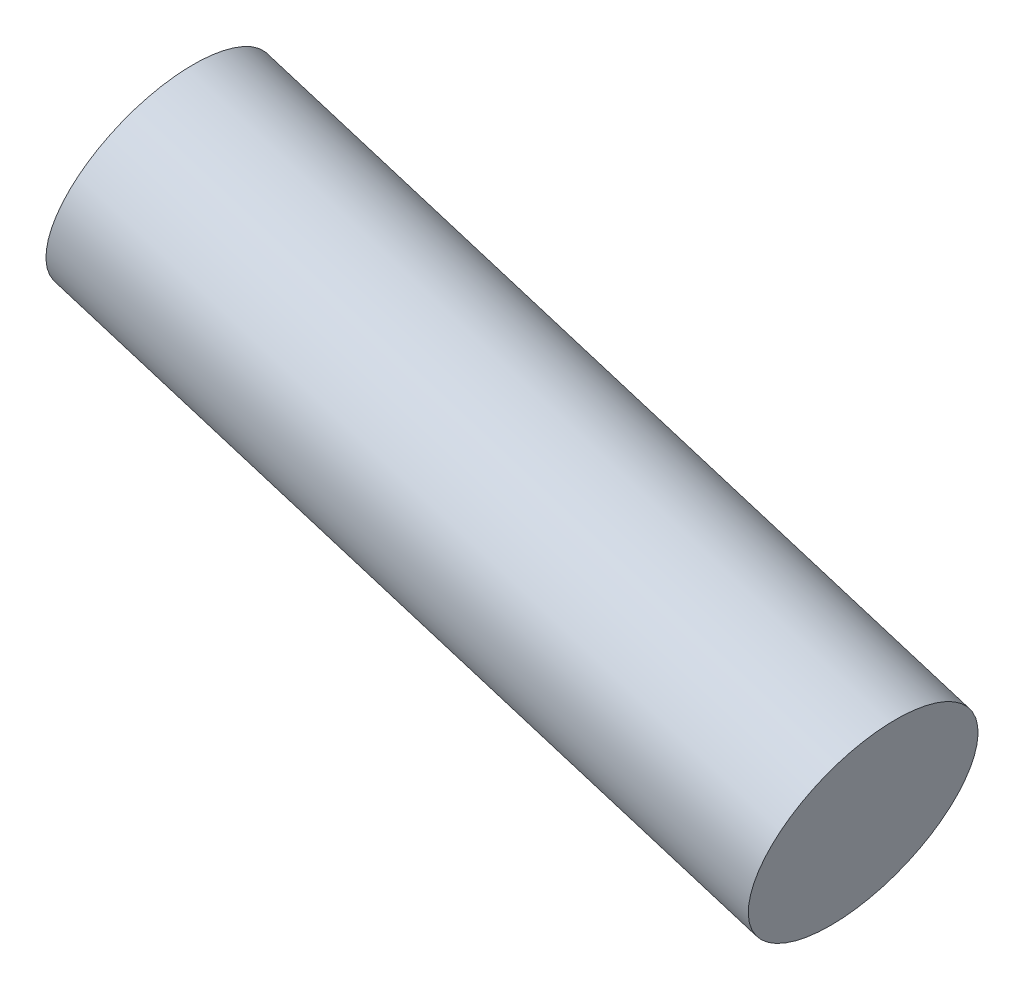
from build123d import *


with BuildPart() as part:
    # Skizze1 → Rotation1 (revolve)
    with BuildSketch(Plane.XY, mode=Mode.PRIVATE) as rotation1_sk:
        Polygon((769.020865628, -220.979429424), (764.608693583, -235.315842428), (860.184780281, -264.730322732), (864.596952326, -250.393909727), align=None)
    revolve(rotation1_sk.sketch.rotate(Axis((764.608693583, -235.315842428, 0), (0.9557608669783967, -0.29414480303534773, 0)), 180), axis=Axis((764.608693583, -235.315842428, 0), (0.9557608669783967, -0.29414480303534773, 0)))


solid = part.part
